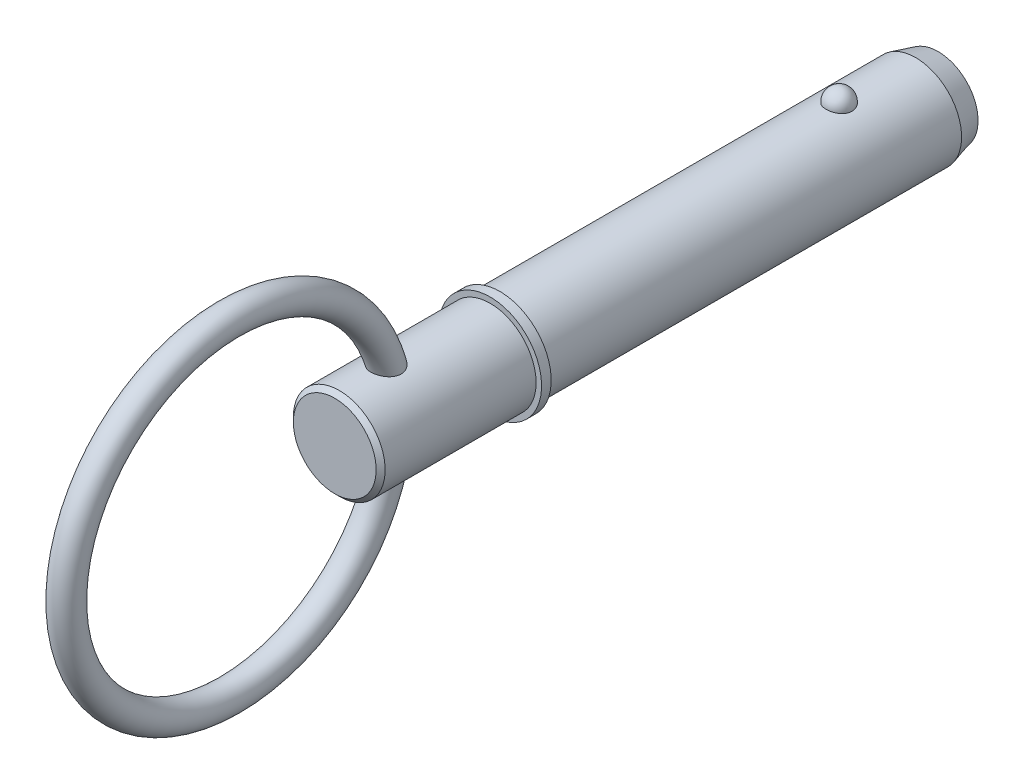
ISO-10303-21;
HEADER;
FILE_DESCRIPTION(('STEP AP214'),'2;1');
FILE_NAME('part.step','',(''),(''),'','','');
FILE_SCHEMA(('AUTOMOTIVE_DESIGN { 1 0 10303 214 1 1 1 1 }'));
ENDSEC;
DATA;
#1=APPLICATION_CONTEXT('core data for automotive mechanical design processes');
#2=APPLICATION_PROTOCOL_DEFINITION('international standard','automotive_design',2000,#1);
#3=PRODUCT_CONTEXT('',#1,'mechanical');
#4=PRODUCT('Part','Part','',(#3));
#5=PRODUCT_RELATED_PRODUCT_CATEGORY('part','',(#4));
#6=PRODUCT_DEFINITION_FORMATION('','',#4);
#7=PRODUCT_DEFINITION_CONTEXT('part definition',#1,'design');
#8=PRODUCT_DEFINITION('design','',#6,#7);
#9=PRODUCT_DEFINITION_SHAPE('','',#8);
#10=(LENGTH_UNIT() NAMED_UNIT(*) SI_UNIT(.MILLI.,.METRE.));
#11=(NAMED_UNIT(*) PLANE_ANGLE_UNIT() SI_UNIT($,.RADIAN.));
#12=(NAMED_UNIT(*) SI_UNIT($,.STERADIAN.) SOLID_ANGLE_UNIT());
#13=UNCERTAINTY_MEASURE_WITH_UNIT(LENGTH_MEASURE(1.E-05),#10,'distance_accuracy_value','');
#14=(GEOMETRIC_REPRESENTATION_CONTEXT(3) GLOBAL_UNCERTAINTY_ASSIGNED_CONTEXT((#13)) GLOBAL_UNIT_ASSIGNED_CONTEXT((#10,
#11,#12)) REPRESENTATION_CONTEXT('',''));
#15=CARTESIAN_POINT('',(0.,0.,0.));
#16=DIRECTION('',(0.,0.,1.));
#17=DIRECTION('',(1.,0.,0.));
#18=AXIS2_PLACEMENT_3D('',#15,#16,#17);
#19=CARTESIAN_POINT('',(0.,0.,50.8));
#20=DIRECTION('',(0.,0.,-1.));
#21=DIRECTION('',(-1.,0.,0.));
#22=AXIS2_PLACEMENT_3D('',#19,#20,#21);
#23=CYLINDRICAL_SURFACE('',#22,7.145);
#24=CARTESIAN_POINT('',(1.99971637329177,6.85945766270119,-2.02));
#25=CARTESIAN_POINT('',(1.9997145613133,6.85945924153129,-1.9070973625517));
#26=CARTESIAN_POINT('',(1.99051486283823,6.86216053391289,-1.79417185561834));
#27=CARTESIAN_POINT('',(1.95393597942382,6.87266409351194,-1.57152267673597));
#28=CARTESIAN_POINT('',(1.92655029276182,6.88046818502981,-1.46180016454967));
#29=CARTESIAN_POINT('',(1.85429435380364,6.90029063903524,-1.24873107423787));
#30=CARTESIAN_POINT('',(1.80943177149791,6.91230715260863,-1.14538172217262));
#31=CARTESIAN_POINT('',(1.70333474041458,6.93921158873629,-0.947875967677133));
#32=CARTESIAN_POINT('',(1.64210059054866,6.95409945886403,-0.853719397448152));
#33=CARTESIAN_POINT('',(1.5044381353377,6.98517577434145,-0.676721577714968));
#34=CARTESIAN_POINT('',(1.42793505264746,7.00137037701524,-0.593939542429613));
#35=CARTESIAN_POINT('',(1.26189697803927,7.03319066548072,-0.442536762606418));
#36=CARTESIAN_POINT('',(1.17236198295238,7.04881635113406,-0.373916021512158));
#37=CARTESIAN_POINT('',(0.982932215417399,7.0777121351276,-0.252935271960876));
#38=CARTESIAN_POINT('',(0.883068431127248,7.09098897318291,-0.200528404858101));
#39=CARTESIAN_POINT('',(0.675560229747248,7.11375589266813,-0.113212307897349));
#40=CARTESIAN_POINT('',(0.567916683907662,7.12324639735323,-0.0783011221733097));
#41=CARTESIAN_POINT('',(0.350006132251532,7.13724173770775,-0.0274707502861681));
#42=CARTESIAN_POINT('',(0.239822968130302,7.14183447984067,-0.0112162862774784));
#43=CARTESIAN_POINT('',(0.0181946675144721,7.14583597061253,0.00296794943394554));
#44=CARTESIAN_POINT('',(-0.0932503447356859,7.14524522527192,0.000899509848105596));
#45=CARTESIAN_POINT('',(-0.312527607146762,7.13899247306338,-0.02133316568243));
#46=CARTESIAN_POINT('',(-0.420388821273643,7.13340426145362,-0.0412340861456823));
#47=CARTESIAN_POINT('',(-0.631141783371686,7.11785474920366,-0.0982040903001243));
#48=CARTESIAN_POINT('',(-0.734033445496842,7.10789337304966,-0.135273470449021));
#49=CARTESIAN_POINT('',(-0.932634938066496,7.08458058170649,-0.225826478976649));
#50=CARTESIAN_POINT('',(-1.02829911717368,7.07120963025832,-0.279405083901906));
#51=CARTESIAN_POINT('',(-1.20927180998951,7.04252043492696,-0.401457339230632));
#52=CARTESIAN_POINT('',(-1.29457925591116,7.02720199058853,-0.469932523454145));
#53=CARTESIAN_POINT('',(-1.45423311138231,6.995926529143,-0.621438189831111));
#54=CARTESIAN_POINT('',(-1.5283348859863,6.97996288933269,-0.704725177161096));
#55=CARTESIAN_POINT('',(-1.66169281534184,6.94942414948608,-0.882667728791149));
#56=CARTESIAN_POINT('',(-1.72094789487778,6.93484915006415,-0.977324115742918));
#57=CARTESIAN_POINT('',(-1.82375276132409,6.90853186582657,-1.17661373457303));
#58=CARTESIAN_POINT('',(-1.86711024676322,6.8968248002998,-1.28135093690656));
#59=CARTESIAN_POINT('',(-1.9360425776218,6.87779420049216,-1.49689986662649));
#60=CARTESIAN_POINT('',(-1.96161794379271,6.87047053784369,-1.60771141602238));
#61=CARTESIAN_POINT('',(-1.99427437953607,6.86106309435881,-1.83176258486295));
#62=CARTESIAN_POINT('',(-2.00143373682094,6.8589571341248,-1.94498985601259));
#63=CARTESIAN_POINT('',(-1.99730449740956,6.86016064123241,-2.17107603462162));
#64=CARTESIAN_POINT('',(-1.98601641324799,6.86346995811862,-2.28393495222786));
#65=CARTESIAN_POINT('',(-1.94538181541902,6.87509649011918,-2.5054843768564));
#66=CARTESIAN_POINT('',(-1.91612773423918,6.88338806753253,-2.61419321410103));
#67=CARTESIAN_POINT('',(-1.84036449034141,6.90402888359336,-2.8250124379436));
#68=CARTESIAN_POINT('',(-1.79385462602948,6.91637828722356,-2.92712255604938));
#69=CARTESIAN_POINT('',(-1.68442067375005,6.94384180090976,-3.12247704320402));
#70=CARTESIAN_POINT('',(-1.62140729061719,6.95897081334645,-3.21566929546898));
#71=CARTESIAN_POINT('',(-1.4806650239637,6.99026742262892,-3.38999412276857));
#72=CARTESIAN_POINT('',(-1.40293556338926,7.00643506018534,-3.47112622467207));
#73=CARTESIAN_POINT('',(-1.2344320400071,7.03807960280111,-3.61938672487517));
#74=CARTESIAN_POINT('',(-1.1436092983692,7.05355363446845,-3.68646046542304));
#75=CARTESIAN_POINT('',(-0.9515914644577,7.08201263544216,-3.80431973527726));
#76=CARTESIAN_POINT('',(-0.850397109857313,7.09499778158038,-3.85510642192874));
#77=CARTESIAN_POINT('',(-0.641823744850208,7.11687679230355,-3.93839532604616));
#78=CARTESIAN_POINT('',(-0.534539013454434,7.1258202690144,-3.97112042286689));
#79=CARTESIAN_POINT('',(-0.315743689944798,7.1388605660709,-4.01830716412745));
#80=CARTESIAN_POINT('',(-0.204233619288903,7.14295798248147,-4.0327710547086));
#81=CARTESIAN_POINT('',(0.0175518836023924,7.14582273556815,-4.04291389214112));
#82=CARTESIAN_POINT('',(0.127809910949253,7.14469090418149,-4.03894819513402));
#83=CARTESIAN_POINT('',(0.346044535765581,7.13745046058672,-4.01315850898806));
#84=CARTESIAN_POINT('',(0.454021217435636,7.13134203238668,-3.99133518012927));
#85=CARTESIAN_POINT('',(0.664227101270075,7.11483713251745,-3.93057164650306));
#86=CARTESIAN_POINT('',(0.766477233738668,7.10445761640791,-3.89169908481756));
#87=CARTESIAN_POINT('',(0.962929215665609,7.08050813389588,-3.79792023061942));
#88=CARTESIAN_POINT('',(1.05713054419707,7.06693796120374,-3.7430129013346));
#89=CARTESIAN_POINT('',(1.23644031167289,7.03780007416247,-3.61765173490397));
#90=CARTESIAN_POINT('',(1.32138387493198,7.0222044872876,-3.54696861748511));
#91=CARTESIAN_POINT('',(1.47830582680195,6.99085504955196,-3.39245228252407));
#92=CARTESIAN_POINT('',(1.55028198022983,6.97510117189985,-3.30861680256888));
#93=CARTESIAN_POINT('',(1.68063701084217,6.94485803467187,-3.12843058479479));
#94=CARTESIAN_POINT('',(1.73875175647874,6.93039619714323,-3.03188405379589));
#95=CARTESIAN_POINT('',(1.83823393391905,6.90467783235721,-2.83015210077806));
#96=CARTESIAN_POINT('',(1.87960712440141,6.89342020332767,-2.72496966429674));
#97=CARTESIAN_POINT('',(1.94111647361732,6.87633596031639,-2.52050234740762));
#98=CARTESIAN_POINT('',(1.96305249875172,6.87005682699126,-2.42179225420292));
#99=CARTESIAN_POINT('',(1.99235308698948,6.86161702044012,-2.22206084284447));
#100=CARTESIAN_POINT('',(1.99971799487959,6.85945624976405,-2.12103957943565));
#101=CARTESIAN_POINT('',(1.99971637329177,6.85945766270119,-2.02));
#102=B_SPLINE_CURVE_WITH_KNOTS('',3,(#24,#25,#26,#27,#28,#29,#30,#31,#32,#33,#34,#35,#36,#37,
#38,#39,#40,#41,#42,#43,#44,#45,#46,#47,#48,#49,#50,#51,#52,#53,#54,#55,#56,#57,#58,#59,#60,#61,
#62,#63,#64,#65,#66,#67,#68,#69,#70,#71,#72,#73,#74,#75,#76,#77,#78,#79,#80,#81,#82,#83,#84,#85,
#86,#87,#88,#89,#90,#91,#92,#93,#94,#95,#96,#97,#98,#99,#100,#101),.UNSPECIFIED.,.T.,.F.,(4,2,2,
2,2,2,2,2,2,2,2,2,2,2,2,2,2,2,2,2,2,2,2,2,2,2,2,2,2,2,2,2,2,2,2,2,2,2,4),(0.,0.338345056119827,
0.676811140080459,1.01512885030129,1.35344038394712,1.69345130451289,2.03346230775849,
2.37248128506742,2.71146235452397,3.04425125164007,3.37700766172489,3.70493009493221,
4.03285819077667,4.36270921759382,4.69259422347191,5.02887632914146,5.36518278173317,
5.70543263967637,6.04567253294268,6.38446363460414,6.72324532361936,7.06029846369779,
7.39736530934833,7.73629500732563,8.07523799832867,8.41547528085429,8.7556883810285,
9.09160363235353,9.42747756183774,9.75690239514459,10.0863150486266,10.4144324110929,
10.7425709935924,11.0758313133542,11.4091490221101,11.748385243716,12.0875046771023,
12.3903058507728,12.6930998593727),.UNSPECIFIED.);
#103=CARTESIAN_POINT('',(1.99971637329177,6.85945766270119,-2.02));
#104=VERTEX_POINT('',#103);
#105=EDGE_CURVE('E102',#104,#104,#102,.T.);
#106=ORIENTED_EDGE('',*,*,#105,.T.);
#107=EDGE_LOOP('',(#106));
#108=FACE_BOUND('',#107,.T.);
#109=CARTESIAN_POINT('',(0.,0.,-13.95));
#110=DIRECTION('',(0.,0.,-1.));
#111=DIRECTION('',(-1.,0.,0.));
#112=AXIS2_PLACEMENT_3D('',#109,#110,#111);
#113=CIRCLE('',#112,7.145);
#114=CARTESIAN_POINT('',(-7.145,0.,-13.95));
#115=VERTEX_POINT('',#114);
#116=EDGE_CURVE('E110',#115,#115,#113,.F.);
#117=ORIENTED_EDGE('',*,*,#116,.T.);
#118=EDGE_LOOP('',(#117));
#119=FACE_BOUND('',#118,.T.);
#120=CARTESIAN_POINT('',(0.,0.,50.8));
#121=DIRECTION('',(0.,0.,1.));
#122=DIRECTION('',(1.,0.,0.));
#123=AXIS2_PLACEMENT_3D('',#120,#121,#122);
#124=CIRCLE('',#123,7.145);
#125=CARTESIAN_POINT('',(7.145,0.,50.8));
#126=VERTEX_POINT('',#125);
#127=EDGE_CURVE('E108',#126,#126,#124,.T.);
#128=ORIENTED_EDGE('',*,*,#127,.F.);
#129=EDGE_LOOP('',(#128));
#130=FACE_BOUND('',#129,.T.);
#131=ADVANCED_FACE('F39',(#108,#119,#130),#23,.T.);
#132=CARTESIAN_POINT('',(0.,0.,-17.45));
#133=DIRECTION('',(0.,0.,-1.));
#134=DIRECTION('',(-1.,0.,0.));
#135=AXIS2_PLACEMENT_3D('',#132,#133,#134);
#136=PLANE('',#135);
#137=CARTESIAN_POINT('',(0.,0.,-17.45));
#138=DIRECTION('',(0.,0.,-1.));
#139=DIRECTION('',(-1.,0.,0.));
#140=AXIS2_PLACEMENT_3D('',#137,#138,#139);
#141=CIRCLE('',#140,6.20717782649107);
#142=CARTESIAN_POINT('',(-6.20717782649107,0.,-17.45));
#143=VERTEX_POINT('',#142);
#144=EDGE_CURVE('E142',#143,#143,#141,.T.);
#145=ORIENTED_EDGE('',*,*,#144,.T.);
#146=EDGE_LOOP('',(#145));
#147=FACE_BOUND('',#146,.T.);
#148=ADVANCED_FACE('F88',(#147),#136,.T.);
#149=CARTESIAN_POINT('',(0.,0.,-17.45));
#150=DIRECTION('',(0.,0.,1.));
#151=DIRECTION('',(1.,0.,0.));
#152=AXIS2_PLACEMENT_3D('',#149,#150,#151);
#153=CONICAL_SURFACE('',#152,6.20717782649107,0.261799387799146);
#154=ORIENTED_EDGE('',*,*,#116,.F.);
#155=EDGE_LOOP('',(#154));
#156=FACE_BOUND('',#155,.T.);
#157=ORIENTED_EDGE('',*,*,#144,.F.);
#158=EDGE_LOOP('',(#157));
#159=FACE_BOUND('',#158,.T.);
#160=ADVANCED_FACE('F94',(#156,#159),#153,.T.);
#161=CARTESIAN_POINT('',(0.,7.145,-2.02));
#162=DIRECTION('',(0.,1.,0.));
#163=DIRECTION('',(0.,0.,-1.));
#164=AXIS2_PLACEMENT_3D('',#161,#162,#163);
#165=SPHERICAL_SURFACE('',#164,2.02);
#166=ORIENTED_EDGE('',*,*,#105,.F.);
#167=EDGE_LOOP('',(#166));
#168=FACE_BOUND('',#167,.T.);
#169=ADVANCED_FACE('F113',(#168),#165,.T.);
#170=CARTESIAN_POINT('',(0.,0.,50.8));
#171=DIRECTION('',(0.,0.,-1.));
#172=DIRECTION('',(-1.,0.,0.));
#173=AXIS2_PLACEMENT_3D('',#170,#171,#172);
#174=PLANE('',#173);
#175=ORIENTED_EDGE('',*,*,#127,.T.);
#176=EDGE_LOOP('',(#175));
#177=FACE_BOUND('',#176,.T.);
#178=CARTESIAN_POINT('',(0.,0.,50.8));
#179=DIRECTION('',(0.,0.,-1.));
#180=DIRECTION('',(-1.,0.,0.));
#181=AXIS2_PLACEMENT_3D('',#178,#179,#180);
#182=CIRCLE('',#181,8.);
#183=CARTESIAN_POINT('',(-8.,0.,50.8));
#184=VERTEX_POINT('',#183);
#185=EDGE_CURVE('E109',#184,#184,#182,.T.);
#186=ORIENTED_EDGE('',*,*,#185,.T.);
#187=EDGE_LOOP('',(#186));
#188=FACE_BOUND('',#187,.T.);
#189=ADVANCED_FACE('F117',(#177,#188),#174,.T.);
#190=CARTESIAN_POINT('',(0.,0.,33.7287874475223));
#191=DIRECTION('',(0.,0.,-1.));
#192=DIRECTION('',(-1.,0.,0.));
#193=AXIS2_PLACEMENT_3D('',#190,#191,#192);
#194=CYLINDRICAL_SURFACE('',#193,8.);
#195=CARTESIAN_POINT('',(0.,0.,52.3));
#196=DIRECTION('',(0.,0.,-1.));
#197=DIRECTION('',(-1.,0.,0.));
#198=AXIS2_PLACEMENT_3D('',#195,#196,#197);
#199=CIRCLE('',#198,8.);
#200=CARTESIAN_POINT('',(-8.,0.,52.3));
#201=VERTEX_POINT('',#200);
#202=EDGE_CURVE('E134',#201,#201,#199,.T.);
#203=ORIENTED_EDGE('',*,*,#202,.T.);
#204=EDGE_LOOP('',(#203));
#205=FACE_BOUND('',#204,.T.);
#206=ORIENTED_EDGE('',*,*,#185,.F.);
#207=EDGE_LOOP('',(#206));
#208=FACE_BOUND('',#207,.T.);
#209=ADVANCED_FACE('F121',(#205,#208),#194,.T.);
#210=CARTESIAN_POINT('',(0.,8.,52.3));
#211=DIRECTION('',(0.,0.,1.));
#212=DIRECTION('',(1.,0.,0.));
#213=AXIS2_PLACEMENT_3D('',#210,#211,#212);
#214=PLANE('',#213);
#215=CARTESIAN_POINT('',(0.,0.,52.3));
#216=DIRECTION('',(0.,0.,1.));
#217=DIRECTION('',(1.,0.,0.));
#218=AXIS2_PLACEMENT_3D('',#215,#216,#217);
#219=CIRCLE('',#218,7.145);
#220=CARTESIAN_POINT('',(7.145,0.,52.3));
#221=VERTEX_POINT('',#220);
#222=EDGE_CURVE('E112',#221,#221,#219,.T.);
#223=ORIENTED_EDGE('',*,*,#222,.F.);
#224=EDGE_LOOP('',(#223));
#225=FACE_BOUND('',#224,.T.);
#226=ORIENTED_EDGE('',*,*,#202,.F.);
#227=EDGE_LOOP('',(#226));
#228=FACE_BOUND('',#227,.T.);
#229=ADVANCED_FACE('F85',(#225,#228),#214,.T.);
#230=CARTESIAN_POINT('',(0.,0.,76.5));
#231=DIRECTION('',(0.,0.,-1.));
#232=DIRECTION('',(-1.,0.,0.));
#233=AXIS2_PLACEMENT_3D('',#230,#231,#232);
#234=CYLINDRICAL_SURFACE('',#233,7.145);
#235=CARTESIAN_POINT('',(-1.03551034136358,-7.0695645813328,66.4302593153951));
#236=CARTESIAN_POINT('',(-0.923225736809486,-7.08601142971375,66.3744028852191));
#237=CARTESIAN_POINT('',(-0.806039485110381,-7.10042113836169,66.3278354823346));
#238=CARTESIAN_POINT('',(-0.565173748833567,-7.1236385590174,66.2542799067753));
#239=CARTESIAN_POINT('',(-0.441495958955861,-7.13244772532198,66.2272866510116));
#240=CARTESIAN_POINT('',(-0.191106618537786,-7.14354309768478,66.193450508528));
#241=CARTESIAN_POINT('',(-0.064394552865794,-7.14582818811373,66.186611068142));
#242=CARTESIAN_POINT('',(0.188443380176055,-7.14363337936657,66.1932414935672));
#243=CARTESIAN_POINT('',(0.314569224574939,-7.13915321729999,66.2067121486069));
#244=CARTESIAN_POINT('',(0.562499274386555,-7.12390574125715,66.2536416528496));
#245=CARTESIAN_POINT('',(0.684308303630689,-7.11314569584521,66.2870773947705));
#246=CARTESIAN_POINT('',(0.920329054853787,-7.08647538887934,66.373194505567));
#247=CARTESIAN_POINT('',(1.03454038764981,-7.07056486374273,66.4258768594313));
#248=CARTESIAN_POINT('',(1.25232634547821,-7.03526161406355,66.5494470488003));
#249=CARTESIAN_POINT('',(1.35588248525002,-7.01586299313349,66.6203658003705));
#250=CARTESIAN_POINT('',(1.54916093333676,-6.9757352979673,66.7787573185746));
#251=CARTESIAN_POINT('',(1.63888414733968,-6.95500631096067,66.8662290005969));
#252=CARTESIAN_POINT('',(1.80113983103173,-6.91475703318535,67.0547277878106));
#253=CARTESIAN_POINT('',(1.8738192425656,-6.89522757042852,67.1556263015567));
#254=CARTESIAN_POINT('',(2.00091178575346,-6.85942834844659,67.36884010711));
#255=CARTESIAN_POINT('',(2.05532963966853,-6.8431577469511,67.4811524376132));
#256=CARTESIAN_POINT('',(2.14350100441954,-6.81604873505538,67.7111948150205));
#257=CARTESIAN_POINT('',(2.17770329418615,-6.80509340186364,67.8287395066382));
#258=CARTESIAN_POINT('',(2.22691394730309,-6.7891497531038,68.068149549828));
#259=CARTESIAN_POINT('',(2.2419216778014,-6.7841616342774,68.1900150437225));
#260=CARTESIAN_POINT('',(2.25313992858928,-6.78044381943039,68.4358069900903));
#261=CARTESIAN_POINT('',(2.24917302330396,-6.78177319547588,68.5597420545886));
#262=CARTESIAN_POINT('',(2.22301329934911,-6.79039131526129,68.8054389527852));
#263=CARTESIAN_POINT('',(2.20081491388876,-6.79768187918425,68.9272001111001));
#264=CARTESIAN_POINT('',(2.13702421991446,-6.81801706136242,69.1752873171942));
#265=CARTESIAN_POINT('',(2.09404815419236,-6.83146790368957,69.3012230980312));
#266=CARTESIAN_POINT('',(1.9898638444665,-6.86253672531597,69.5448244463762));
#267=CARTESIAN_POINT('',(1.9286413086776,-6.88015796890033,69.6624834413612));
#268=CARTESIAN_POINT('',(1.78274362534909,-6.91947130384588,69.8974979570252));
#269=CARTESIAN_POINT('',(1.69640701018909,-6.94139021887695,70.0137892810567));
#270=CARTESIAN_POINT('',(1.50503944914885,-6.98537683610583,70.2297996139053));
#271=CARTESIAN_POINT('',(1.40001969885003,-7.00744444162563,70.329528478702));
#272=CARTESIAN_POINT('',(1.19221781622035,-7.04548349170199,70.493170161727));
#273=CARTESIAN_POINT('',(1.09203347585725,-7.06185586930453,70.5602859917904));
#274=CARTESIAN_POINT('',(0.88160718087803,-7.09119477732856,70.677337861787));
#275=CARTESIAN_POINT('',(0.771372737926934,-7.10416382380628,70.7272866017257));
#276=CARTESIAN_POINT('',(0.542622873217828,-7.12529560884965,70.807475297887));
#277=CARTESIAN_POINT('',(0.424058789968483,-7.13342692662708,70.8375865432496));
#278=CARTESIAN_POINT('',(0.183155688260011,-7.14366628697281,70.8753706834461));
#279=CARTESIAN_POINT('',(0.060819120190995,-7.14577815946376,70.883057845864));
#280=CARTESIAN_POINT('',(-0.16936769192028,-7.14381572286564,70.8758601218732));
#281=CARTESIAN_POINT('',(-0.27730825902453,-7.14040669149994,70.8634029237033));
#282=CARTESIAN_POINT('',(-0.489468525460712,-7.12900651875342,70.8211569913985));
#283=CARTESIAN_POINT('',(-0.593687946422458,-7.12101503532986,70.7913669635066));
#284=CARTESIAN_POINT('',(-0.796149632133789,-7.10123695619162,70.7159872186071));
#285=CARTESIAN_POINT('',(-0.894373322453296,-7.08943921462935,70.6703510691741));
#286=CARTESIAN_POINT('',(-1.08274371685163,-7.06312621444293,70.5653366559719));
#287=CARTESIAN_POINT('',(-1.17288754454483,-7.04860999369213,70.5059535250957));
#288=CARTESIAN_POINT('',(-1.35484961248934,-7.01605385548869,70.3671134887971));
#289=CARTESIAN_POINT('',(-1.44541008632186,-6.99780069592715,70.2860611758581));
#290=CARTESIAN_POINT('',(-1.61364655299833,-6.96093393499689,70.1115990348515));
#291=CARTESIAN_POINT('',(-1.69131381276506,-6.94232009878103,70.0181809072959));
#292=CARTESIAN_POINT('',(-1.843300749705,-6.90364386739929,69.8066087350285));
#293=CARTESIAN_POINT('',(-1.91543090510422,-6.88377370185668,69.6868392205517));
#294=CARTESIAN_POINT('',(-2.0400294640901,-6.84788436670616,69.4368759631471));
#295=CARTESIAN_POINT('',(-2.09248830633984,-6.83186707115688,69.3066771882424));
#296=CARTESIAN_POINT('',(-2.17795964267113,-6.80511869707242,69.0325553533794));
#297=CARTESIAN_POINT('',(-2.20992909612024,-6.79467512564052,68.8882740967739));
#298=CARTESIAN_POINT('',(-2.24813111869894,-6.78213595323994,68.5959843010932));
#299=CARTESIAN_POINT('',(-2.25438316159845,-6.78003403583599,68.4479786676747));
#300=CARTESIAN_POINT('',(-2.24011368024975,-6.78475868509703,68.1654300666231));
#301=CARTESIAN_POINT('',(-2.22172362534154,-6.79087455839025,68.0307692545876));
#302=CARTESIAN_POINT('',(-2.16145328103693,-6.81029672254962,67.7673673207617));
#303=CARTESIAN_POINT('',(-2.11958615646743,-6.82359898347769,67.6386229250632));
#304=CARTESIAN_POINT('',(-2.01784121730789,-6.85433303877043,67.4022679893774));
#305=CARTESIAN_POINT('',(-1.9598239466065,-6.8713108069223,67.2937922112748));
#306=CARTESIAN_POINT('',(-1.82642155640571,-6.90796511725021,67.0885914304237));
#307=CARTESIAN_POINT('',(-1.75103235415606,-6.92764229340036,66.9918691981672));
#308=CARTESIAN_POINT('',(-1.57825515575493,-6.96911949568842,66.8054086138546));
#309=CARTESIAN_POINT('',(-1.47957996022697,-6.9909623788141,66.7168703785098));
#310=CARTESIAN_POINT('',(-1.26760341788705,-7.0324852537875,66.558840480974));
#311=CARTESIAN_POINT('',(-1.15429989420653,-7.05216492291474,66.4893516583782));
#312=CARTESIAN_POINT('',(-1.03551034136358,-7.0695645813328,66.4302593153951));
#313=B_SPLINE_CURVE_WITH_KNOTS('',3,(#235,#236,#237,#238,#239,#240,#241,#242,#243,#244,#245,
#246,#247,#248,#249,#250,#251,#252,#253,#254,#255,#256,#257,#258,#259,#260,#261,#262,#263,#264,
#265,#266,#267,#268,#269,#270,#271,#272,#273,#274,#275,#276,#277,#278,#279,#280,#281,#282,#283,
#284,#285,#286,#287,#288,#289,#290,#291,#292,#293,#294,#295,#296,#297,#298,#299,#300,#301,#302,
#303,#304,#305,#306,#307,#308,#309,#310,#311,#312),.UNSPECIFIED.,.T.,.F.,(4,2,2,2,2,2,2,2,2,2,2,
2,2,2,2,2,2,2,2,2,2,2,2,2,2,2,2,2,2,2,2,2,2,2,2,2,2,2,4),(0.,0.378979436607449,
0.757860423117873,1.13680619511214,1.51576669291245,1.89428943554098,2.2728315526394,
2.65201969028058,3.03118299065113,3.40694616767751,3.78261210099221,4.14959041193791,
4.5165808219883,4.88700951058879,5.25755134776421,5.65713708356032,6.05703662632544,
6.49445595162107,6.93161403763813,7.29520224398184,7.65852089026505,8.02417421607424,
8.38959483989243,8.71415763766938,9.03874466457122,9.36429093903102,9.68995264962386,
10.0572255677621,10.4247462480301,10.8465602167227,11.2685789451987,11.7106604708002,
12.152407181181,12.5583067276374,12.9639788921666,13.3347314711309,13.7055712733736,
14.1064462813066,14.5073810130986),.UNSPECIFIED.);
#314=CARTESIAN_POINT('',(-1.03551034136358,-7.0695645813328,66.4302593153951));
#315=VERTEX_POINT('',#314);
#316=EDGE_CURVE('E10',#315,#315,#313,.T.);
#317=ORIENTED_EDGE('',*,*,#316,.F.);
#318=EDGE_LOOP('',(#317));
#319=FACE_BOUND('',#318,.T.);
#320=CARTESIAN_POINT('',(-1.03551034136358,7.0695645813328,66.4302593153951));
#321=CARTESIAN_POINT('',(-1.14644953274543,7.05331457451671,66.485446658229));
#322=CARTESIAN_POINT('',(-1.25260902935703,7.03507806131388,66.5497022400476));
#323=CARTESIAN_POINT('',(-1.45240021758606,6.99656564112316,66.6949589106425));
#324=CARTESIAN_POINT('',(-1.54602879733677,6.97628922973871,66.7759641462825));
#325=CARTESIAN_POINT('',(-1.71815091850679,6.93590796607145,66.9529100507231));
#326=CARTESIAN_POINT('',(-1.79663177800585,6.91580327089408,67.0488631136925));
#327=CARTESIAN_POINT('',(-1.9360771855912,6.87807159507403,67.2531625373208));
#328=CARTESIAN_POINT('',(-1.99704642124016,6.86044395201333,67.3615055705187));
#329=CARTESIAN_POINT('',(-2.09894945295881,6.82995115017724,67.5855428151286));
#330=CARTESIAN_POINT('',(-2.14021253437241,6.81700866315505,67.7010768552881));
#331=CARTESIAN_POINT('',(-2.20347311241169,6.79682602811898,67.9377588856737));
#332=CARTESIAN_POINT('',(-2.22547114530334,6.78958572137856,68.0589067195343));
#333=CARTESIAN_POINT('',(-2.25026114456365,6.78140983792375,68.3032142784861));
#334=CARTESIAN_POINT('',(-2.25306986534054,6.78046876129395,68.4263721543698));
#335=CARTESIAN_POINT('',(-2.2403056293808,6.78469532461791,68.6716049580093));
#336=CARTESIAN_POINT('',(-2.22472720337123,6.78986478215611,68.7936795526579));
#337=CARTESIAN_POINT('',(-2.1747213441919,6.8060520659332,69.0420367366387));
#338=CARTESIAN_POINT('',(-2.13910164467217,6.81743831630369,69.1680537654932));
#339=CARTESIAN_POINT('',(-2.04975058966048,6.84483151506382,69.4129736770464));
#340=CARTESIAN_POINT('',(-1.99600968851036,6.86084089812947,69.5318727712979));
#341=CARTESIAN_POINT('',(-1.86558545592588,6.8975101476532,69.7714258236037));
#342=CARTESIAN_POINT('',(-1.78715729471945,6.91847353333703,69.8910877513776));
#343=CARTESIAN_POINT('',(-1.61149373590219,6.96148580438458,70.1156460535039));
#344=CARTESIAN_POINT('',(-1.51424701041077,6.98353533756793,70.2205334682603));
#345=CARTESIAN_POINT('',(-1.30107590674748,7.02639179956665,70.4129518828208));
#346=CARTESIAN_POINT('',(-1.18492282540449,7.04717858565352,70.5002366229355));
#347=CARTESIAN_POINT('',(-0.937392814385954,7.08434208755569,70.6508275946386));
#348=CARTESIAN_POINT('',(-0.806039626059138,7.10072555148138,70.7141705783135));
#349=CARTESIAN_POINT('',(-0.550470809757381,7.12475629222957,70.8054837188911));
#350=CARTESIAN_POINT('',(-0.427643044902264,7.13327781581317,70.8370470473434));
#351=CARTESIAN_POINT('',(-0.240556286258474,7.14122488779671,70.8663563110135));
#352=CARTESIAN_POINT('',(-0.177714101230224,7.14306799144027,70.8731199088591));
#353=CARTESIAN_POINT('',(-0.0516470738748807,7.14509121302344,70.8805390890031));
#354=CARTESIAN_POINT('',(0.0115777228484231,7.14527152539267,70.8811953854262));
#355=CARTESIAN_POINT('',(0.182932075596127,7.14347436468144,70.8746165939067));
#356=CARTESIAN_POINT('',(0.29087197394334,7.13986325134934,70.8614086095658));
#357=CARTESIAN_POINT('',(0.502842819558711,7.1280769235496,70.8176904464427));
#358=CARTESIAN_POINT('',(0.606873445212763,7.11990133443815,70.7871788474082));
#359=CARTESIAN_POINT('',(0.809001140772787,7.09978218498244,70.7103786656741));
#360=CARTESIAN_POINT('',(0.90707157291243,7.08782300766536,70.6640246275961));
#361=CARTESIAN_POINT('',(1.09503957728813,7.0612282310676,70.5576208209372));
#362=CARTESIAN_POINT('',(1.1849342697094,7.04659169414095,70.4975662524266));
#363=CARTESIAN_POINT('',(1.36644041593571,7.01380352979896,70.3572339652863));
#364=CARTESIAN_POINT('',(1.45676563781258,6.99544216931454,70.2753442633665));
#365=CARTESIAN_POINT('',(1.62440639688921,6.95842750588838,70.0992310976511));
#366=CARTESIAN_POINT('',(1.70171298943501,6.93977401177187,70.0049992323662));
#367=CARTESIAN_POINT('',(1.85271606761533,6.90111647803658,69.7918074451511));
#368=CARTESIAN_POINT('',(1.92421731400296,6.88131605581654,69.6712480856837));
#369=CARTESIAN_POINT('',(2.04739198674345,6.84567995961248,69.4197850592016));
#370=CARTESIAN_POINT('',(2.09905621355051,6.82984612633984,69.2888766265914));
#371=CARTESIAN_POINT('',(2.1825776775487,6.80363167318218,69.0138472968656));
#372=CARTESIAN_POINT('',(2.21345394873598,6.79352430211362,68.8693978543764));
#373=CARTESIAN_POINT('',(2.24941288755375,6.78170753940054,68.5769846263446));
#374=CARTESIAN_POINT('',(2.2545156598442,6.77999160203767,68.4290236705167));
#375=CARTESIAN_POINT('',(2.2380435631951,6.78544298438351,68.1470530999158));
#376=CARTESIAN_POINT('',(2.21864521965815,6.79188566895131,68.0129037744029));
#377=CARTESIAN_POINT('',(2.1564876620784,6.81187529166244,67.7506903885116));
#378=CARTESIAN_POINT('',(2.11373989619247,6.82541874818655,67.6226233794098));
#379=CARTESIAN_POINT('',(2.01040099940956,6.85652522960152,67.3875077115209));
#380=CARTESIAN_POINT('',(1.9516260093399,6.87365110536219,67.2795975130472));
#381=CARTESIAN_POINT('',(1.81683142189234,6.91050025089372,67.0756496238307));
#382=CARTESIAN_POINT('',(1.74081238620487,6.93022343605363,66.9796115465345));
#383=CARTESIAN_POINT('',(1.57431234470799,6.96992220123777,66.8025418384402));
#384=CARTESIAN_POINT('',(1.48394688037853,6.98989467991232,66.721400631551));
#385=CARTESIAN_POINT('',(1.29081365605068,7.02812243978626,66.5750381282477));
#386=CARTESIAN_POINT('',(1.18804491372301,7.04637758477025,66.5098180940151));
#387=CARTESIAN_POINT('',(0.970386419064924,7.07967210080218,66.3953776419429));
#388=CARTESIAN_POINT('',(0.855272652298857,7.09462807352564,66.3465586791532));
#389=CARTESIAN_POINT('',(0.618143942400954,7.11920826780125,66.2680711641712));
#390=CARTESIAN_POINT('',(0.496128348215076,7.12883198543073,66.2384044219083));
#391=CARTESIAN_POINT('',(0.247581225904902,7.14180209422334,66.1986987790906));
#392=CARTESIAN_POINT('',(0.121020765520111,7.14509609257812,66.1888236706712));
#393=CARTESIAN_POINT('',(-0.132022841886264,7.14489967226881,66.1894154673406));
#394=CARTESIAN_POINT('',(-0.258506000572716,7.14141109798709,66.1998768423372));
#395=CARTESIAN_POINT('',(-0.496649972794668,7.12862600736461,66.2390533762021));
#396=CARTESIAN_POINT('',(-0.608625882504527,7.11987587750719,66.2660553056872));
#397=CARTESIAN_POINT('',(-0.826925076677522,7.09783467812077,66.3362228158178));
#398=CARTESIAN_POINT('',(-0.93324832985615,7.08454358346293,66.3793884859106));
#399=CARTESIAN_POINT('',(-1.03551034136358,7.0695645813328,66.4302593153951));
#400=B_SPLINE_CURVE_WITH_KNOTS('',3,(#320,#321,#322,#323,#324,#325,#326,#327,#328,#329,#330,
#331,#332,#333,#334,#335,#336,#337,#338,#339,#340,#341,#342,#343,#344,#345,#346,#347,#348,#349,
#350,#351,#352,#353,#354,#355,#356,#357,#358,#359,#360,#361,#362,#363,#364,#365,#366,#367,#368,
#369,#370,#371,#372,#373,#374,#375,#376,#377,#378,#379,#380,#381,#382,#383,#384,#385,#386,#387,
#388,#389,#390,#391,#392,#393,#394,#395,#396,#397,#398,#399),.UNSPECIFIED.,.T.,.F.,(4,2,2,2,2,2,
2,2,2,2,2,2,2,2,2,2,2,2,2,2,2,2,2,2,2,2,2,2,2,2,2,2,2,2,2,2,2,2,2,4),(0.,0.374504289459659,
0.749101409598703,1.12401080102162,1.49881974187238,1.86712525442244,2.23542051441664,
2.60339417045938,2.97147730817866,3.36420696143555,3.75714381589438,4.18898920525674,
4.62109535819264,5.05888124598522,5.49599234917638,5.87475353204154,6.06416800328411,
6.25356032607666,6.57826179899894,6.90298992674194,7.22907626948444,7.55527703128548,
7.92373585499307,8.2924468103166,8.71527472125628,9.13829848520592,9.58009907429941,
10.0215549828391,10.4264139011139,10.831074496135,11.2014904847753,11.571894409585,
11.9394538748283,12.3070424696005,12.6830655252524,13.0591241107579,13.4382822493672,
13.8173372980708,14.1625475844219,14.5077597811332),.UNSPECIFIED.);
#401=CARTESIAN_POINT('',(-1.03551034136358,7.0695645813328,66.4302593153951));
#402=VERTEX_POINT('',#401);
#403=EDGE_CURVE('E51',#402,#402,#400,.T.);
#404=ORIENTED_EDGE('',*,*,#403,.F.);
#405=EDGE_LOOP('',(#404));
#406=FACE_BOUND('',#405,.T.);
#407=CARTESIAN_POINT('',(0.,0.,75.8));
#408=DIRECTION('',(0.,0.,-1.));
#409=DIRECTION('',(-1.,0.,0.));
#410=AXIS2_PLACEMENT_3D('',#407,#408,#409);
#411=CIRCLE('',#410,7.145);
#412=CARTESIAN_POINT('',(-7.14499999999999,0.,75.8));
#413=VERTEX_POINT('',#412);
#414=EDGE_CURVE('E64',#413,#413,#411,.T.);
#415=ORIENTED_EDGE('',*,*,#414,.T.);
#416=EDGE_LOOP('',(#415));
#417=FACE_BOUND('',#416,.T.);
#418=ORIENTED_EDGE('',*,*,#222,.T.);
#419=EDGE_LOOP('',(#418));
#420=FACE_BOUND('',#419,.T.);
#421=ADVANCED_FACE('F69',(#319,#406,#417,#420),#234,.T.);
#422=CARTESIAN_POINT('',(0.,0.,76.5));
#423=DIRECTION('',(0.,0.,-1.));
#424=DIRECTION('',(-1.,0.,0.));
#425=AXIS2_PLACEMENT_3D('',#422,#423,#424);
#426=PLANE('',#425);
#427=CARTESIAN_POINT('',(0.,0.,76.5));
#428=DIRECTION('',(0.,0.,-1.));
#429=DIRECTION('',(-1.,0.,0.));
#430=AXIS2_PLACEMENT_3D('',#427,#428,#429);
#431=CIRCLE('',#430,6.44499999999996);
#432=CARTESIAN_POINT('',(-6.44499999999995,0.,76.5));
#433=VERTEX_POINT('',#432);
#434=EDGE_CURVE('E58',#433,#433,#431,.F.);
#435=ORIENTED_EDGE('',*,*,#434,.T.);
#436=EDGE_LOOP('',(#435));
#437=FACE_BOUND('',#436,.T.);
#438=ADVANCED_FACE('F76',(#437),#426,.F.);
#439=CARTESIAN_POINT('',(0.,0.,75.8));
#440=DIRECTION('',(0.,0.,-1.));
#441=DIRECTION('',(-1.,0.,0.));
#442=AXIS2_PLACEMENT_3D('',#439,#440,#441);
#443=CONICAL_SURFACE('',#442,7.145,0.785398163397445);
#444=CARTESIAN_POINT('',(-6.44499999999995,0.,76.5));
#445=CARTESIAN_POINT('',(-6.45229166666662,0.,76.4927083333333));
#446=CARTESIAN_POINT('',(-6.45958333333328,0.,76.4854166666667));
#447=CARTESIAN_POINT('',(-6.47416666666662,0.,76.4708333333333));
#448=CARTESIAN_POINT('',(-6.48145833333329,0.,76.4635416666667));
#449=CARTESIAN_POINT('',(-6.49604166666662,0.,76.4489583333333));
#450=CARTESIAN_POINT('',(-6.50333333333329,0.,76.4416666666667));
#451=CARTESIAN_POINT('',(-6.51791666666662,0.,76.4270833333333));
#452=CARTESIAN_POINT('',(-6.52520833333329,0.,76.4197916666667));
#453=CARTESIAN_POINT('',(-6.53979166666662,0.,76.4052083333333));
#454=CARTESIAN_POINT('',(-6.54708333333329,0.,76.3979166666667));
#455=CARTESIAN_POINT('',(-6.56166666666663,0.,76.3833333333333));
#456=CARTESIAN_POINT('',(-6.56895833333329,0.,76.3760416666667));
#457=CARTESIAN_POINT('',(-6.58354166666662,0.,76.3614583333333));
#458=CARTESIAN_POINT('',(-6.59083333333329,0.,76.3541666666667));
#459=CARTESIAN_POINT('',(-6.60541666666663,0.,76.3395833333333));
#460=CARTESIAN_POINT('',(-6.61270833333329,0.,76.3322916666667));
#461=CARTESIAN_POINT('',(-6.62729166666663,0.,76.3177083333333));
#462=CARTESIAN_POINT('',(-6.63458333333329,0.,76.3104166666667));
#463=CARTESIAN_POINT('',(-6.64916666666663,0.,76.2958333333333));
#464=CARTESIAN_POINT('',(-6.6564583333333,0.,76.2885416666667));
#465=CARTESIAN_POINT('',(-6.67104166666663,0.,76.2739583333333));
#466=CARTESIAN_POINT('',(-6.6783333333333,0.,76.2666666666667));
#467=CARTESIAN_POINT('',(-6.69291666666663,0.,76.2520833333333));
#468=CARTESIAN_POINT('',(-6.7002083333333,0.,76.2447916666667));
#469=CARTESIAN_POINT('',(-6.71479166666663,0.,76.2302083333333));
#470=CARTESIAN_POINT('',(-6.7220833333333,0.,76.2229166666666));
#471=CARTESIAN_POINT('',(-6.73666666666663,0.,76.2083333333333));
#472=CARTESIAN_POINT('',(-6.7439583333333,0.,76.2010416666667));
#473=CARTESIAN_POINT('',(-6.75854166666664,0.,76.1864583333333));
#474=CARTESIAN_POINT('',(-6.7658333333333,0.,76.1791666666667));
#475=CARTESIAN_POINT('',(-6.78041666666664,0.,76.1645833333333));
#476=CARTESIAN_POINT('',(-6.7877083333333,0.,76.1572916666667));
#477=CARTESIAN_POINT('',(-6.80229166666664,0.,76.1427083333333));
#478=CARTESIAN_POINT('',(-6.80958333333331,0.,76.1354166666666));
#479=CARTESIAN_POINT('',(-6.82416666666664,0.,76.1208333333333));
#480=CARTESIAN_POINT('',(-6.83145833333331,0.,76.1135416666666));
#481=CARTESIAN_POINT('',(-6.84604166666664,0.,76.0989583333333));
#482=CARTESIAN_POINT('',(-6.85333333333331,0.,76.0916666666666));
#483=CARTESIAN_POINT('',(-6.86791666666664,0.,76.0770833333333));
#484=CARTESIAN_POINT('',(-6.87520833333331,0.,76.0697916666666));
#485=CARTESIAN_POINT('',(-6.88979166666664,0.,76.0552083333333));
#486=CARTESIAN_POINT('',(-6.89708333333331,0.,76.0479166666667));
#487=CARTESIAN_POINT('',(-6.91166666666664,0.,76.0333333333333));
#488=CARTESIAN_POINT('',(-6.91895833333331,0.,76.0260416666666));
#489=CARTESIAN_POINT('',(-6.93354166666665,0.,76.0114583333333));
#490=CARTESIAN_POINT('',(-6.94083333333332,0.,76.0041666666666));
#491=CARTESIAN_POINT('',(-6.95541666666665,0.,75.9895833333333));
#492=CARTESIAN_POINT('',(-6.96270833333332,0.,75.9822916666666));
#493=CARTESIAN_POINT('',(-6.97729166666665,0.,75.9677083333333));
#494=CARTESIAN_POINT('',(-6.98458333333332,0.,75.9604166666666));
#495=CARTESIAN_POINT('',(-6.99916666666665,0.,75.9458333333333));
#496=CARTESIAN_POINT('',(-7.00645833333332,0.,75.9385416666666));
#497=CARTESIAN_POINT('',(-7.02104166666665,0.,75.9239583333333));
#498=CARTESIAN_POINT('',(-7.02833333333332,0.,75.9166666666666));
#499=CARTESIAN_POINT('',(-7.04291666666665,0.,75.9020833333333));
#500=CARTESIAN_POINT('',(-7.05020833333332,0.,75.8947916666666));
#501=CARTESIAN_POINT('',(-7.06479166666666,0.,75.8802083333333));
#502=CARTESIAN_POINT('',(-7.07208333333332,0.,75.8729166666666));
#503=CARTESIAN_POINT('',(-7.08666666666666,0.,75.8583333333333));
#504=CARTESIAN_POINT('',(-7.09395833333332,0.,75.8510416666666));
#505=CARTESIAN_POINT('',(-7.10854166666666,0.,75.8364583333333));
#506=CARTESIAN_POINT('',(-7.11583333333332,0.,75.8291666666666));
#507=CARTESIAN_POINT('',(-7.13041666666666,0.,75.8145833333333));
#508=CARTESIAN_POINT('',(-7.13770833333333,0.,75.8072916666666));
#509=CARTESIAN_POINT('',(-7.14499999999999,0.,75.8));
#510=B_SPLINE_CURVE_WITH_KNOTS('',3,(#444,#445,#446,#447,#448,#449,#450,#451,#452,#453,#454,
#455,#456,#457,#458,#459,#460,#461,#462,#463,#464,#465,#466,#467,#468,#469,#470,#471,#472,#473,
#474,#475,#476,#477,#478,#479,#480,#481,#482,#483,#484,#485,#486,#487,#488,#489,#490,#491,#492,
#493,#494,#495,#496,#497,#498,#499,#500,#501,#502,#503,#504,#505,#506,#507,#508,#509),
.UNSPECIFIED.,.F.,.F.,(4,2,2,2,2,2,2,2,2,2,2,2,2,2,2,2,2,2,2,2,2,2,2,2,2,2,2,2,2,2,2,2,4),(0.,
0.0309359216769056,0.0618718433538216,0.092807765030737,0.123743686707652,0.154679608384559,
0.185615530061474,0.216551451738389,0.247487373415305,0.278423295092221,0.309359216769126,
0.340295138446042,0.371231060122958,0.402166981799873,0.433102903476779,0.464038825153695,
0.49497474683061,0.525910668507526,0.556846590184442,0.587782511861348,0.618718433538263,
0.649654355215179,0.680590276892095,0.711526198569,0.742462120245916,0.773398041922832,
0.804333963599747,0.835269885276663,0.866205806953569,0.897141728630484,0.9280776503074,
0.959013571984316,0.989949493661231),.UNSPECIFIED.);
#511=EDGE_CURVE('BSEAM41',#433,#413,#510,.T.);
#512=ORIENTED_EDGE('',*,*,#434,.F.);
#513=ORIENTED_EDGE('',*,*,#414,.F.);
#514=ORIENTED_EDGE('',*,*,#511,.T.);
#515=ORIENTED_EDGE('',*,*,#511,.F.);
#516=EDGE_LOOP('',(#512,#514,#513,#515));
#517=FACE_BOUND('',#516,.T.);
#518=ADVANCED_FACE('F41',(#517),#443,.T.);
#519=CARTESIAN_POINT('',(0.,0.,92.9));
#520=DIRECTION('',(1.,0.,0.));
#521=DIRECTION('',(0.,0.,-1.));
#522=AXIS2_PLACEMENT_3D('',#519,#520,#521);
#523=TOROIDAL_SURFACE('',#522,25.4,2.25);
#524=ORIENTED_EDGE('',*,*,#316,.T.);
#525=EDGE_LOOP('',(#524));
#526=FACE_BOUND('',#525,.T.);
#527=ORIENTED_EDGE('',*,*,#403,.T.);
#528=EDGE_LOOP('',(#527));
#529=FACE_BOUND('',#528,.T.);
#530=ADVANCED_FACE('F73',(#526,#529),#523,.T.);
#531=CLOSED_SHELL('',(#131,#148,#160,#169,#189,#209,#229,#421,#438,#518,#530));
#532=MANIFOLD_SOLID_BREP('B2',#531);
#533=ADVANCED_BREP_SHAPE_REPRESENTATION('',(#18,#532),#14);
#534=SHAPE_DEFINITION_REPRESENTATION(#9,#533);
ENDSEC;
END-ISO-10303-21;
